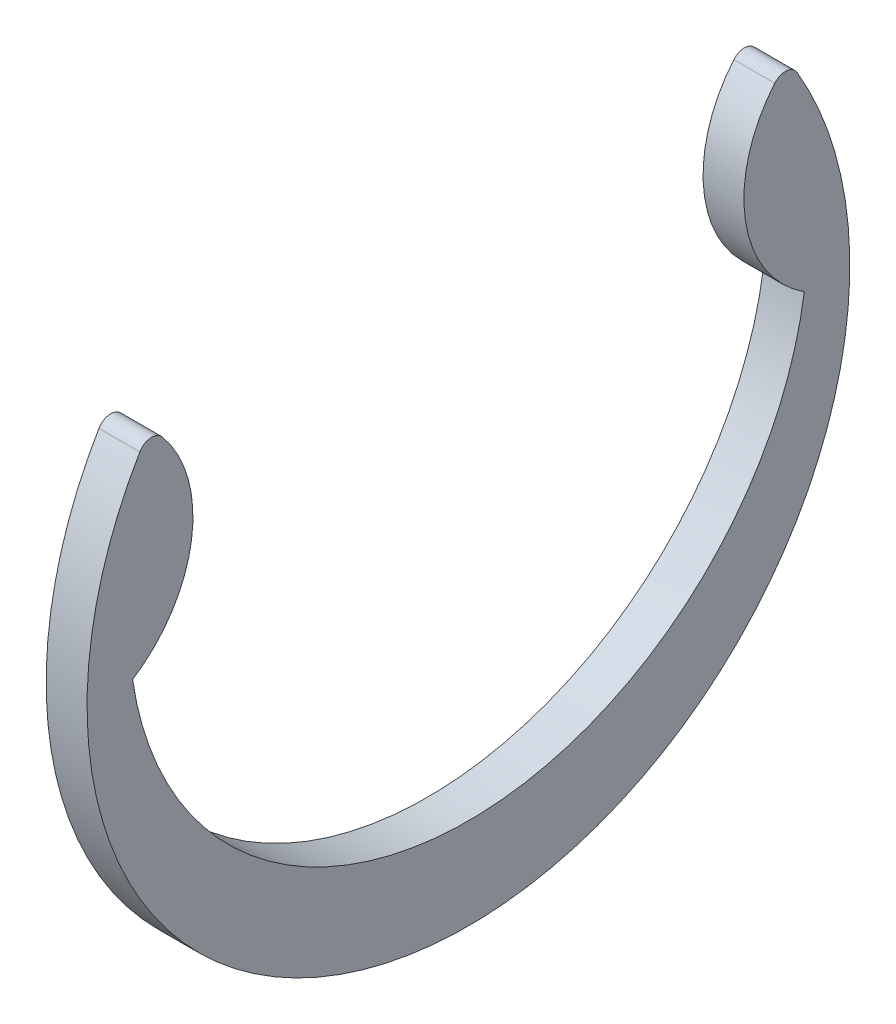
from build123d import *

# Parameters (mm, degrees)
EXTRUDE1_DEPTH = 0.4445


with BuildPart() as part:
    # Sketch1 → Extrude1 (new, symmetric)
    with BuildSketch(Plane(origin=(0, 0, 0), x_dir=(0, 0, -1), z_dir=(1, 0, 0))):
        with BuildLine():
            ThreePointArc((-7.3025, 0), (0, -6.3119), (7.3025, 0))
            ThreePointArc((7.3025, 0), (6.022664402, 1.979168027), (6.660013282, 4.24828055))
            ThreePointArc((6.660013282, 4.24828055), (6.913578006, 4.354033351), (7.146244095, 4.207933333))
            ThreePointArc((7.146244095, 4.207933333), (0, -8.2931), (-7.146244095, 4.207933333))
            ThreePointArc((-7.146244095, 4.207933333), (-6.913578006, 4.354033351), (-6.660013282, 4.24828055))
            ThreePointArc((-6.660013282, 4.24828055), (-6.022664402, 1.979168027), (-7.3025, 0))
        make_face()
    extrude(amount=EXTRUDE1_DEPTH, both=True)


solid = part.part
